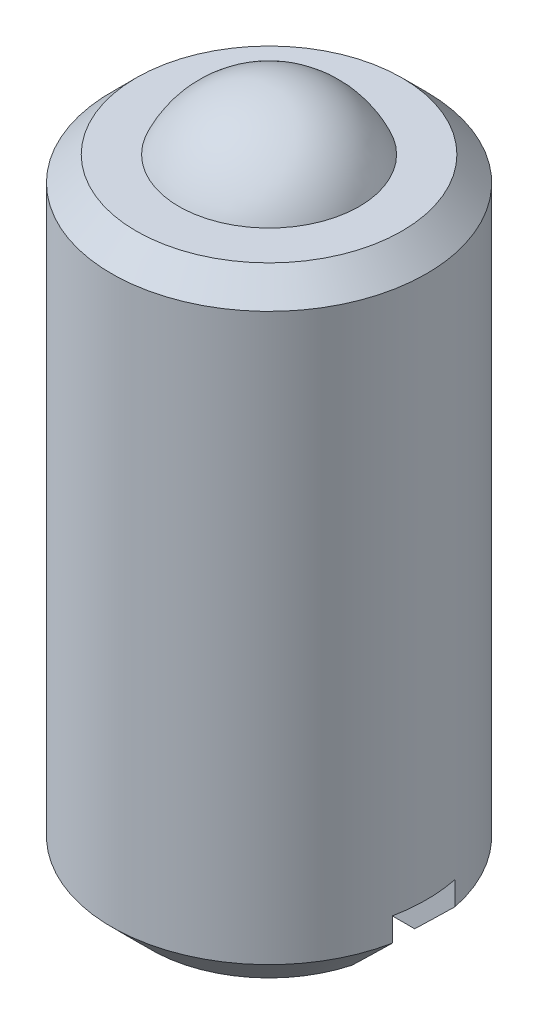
ISO-10303-21;
HEADER;
FILE_DESCRIPTION(('STEP AP214'),'2;1');
FILE_NAME('part.step','',(''),(''),'','','');
FILE_SCHEMA(('AUTOMOTIVE_DESIGN { 1 0 10303 214 1 1 1 1 }'));
ENDSEC;
DATA;
#1=APPLICATION_CONTEXT('core data for automotive mechanical design processes');
#2=APPLICATION_PROTOCOL_DEFINITION('international standard','automotive_design',2000,#1);
#3=PRODUCT_CONTEXT('',#1,'mechanical');
#4=PRODUCT('Part','Part','',(#3));
#5=PRODUCT_RELATED_PRODUCT_CATEGORY('part','',(#4));
#6=PRODUCT_DEFINITION_FORMATION('','',#4);
#7=PRODUCT_DEFINITION_CONTEXT('part definition',#1,'design');
#8=PRODUCT_DEFINITION('design','',#6,#7);
#9=PRODUCT_DEFINITION_SHAPE('','',#8);
#10=(LENGTH_UNIT() NAMED_UNIT(*) SI_UNIT(.MILLI.,.METRE.));
#11=(NAMED_UNIT(*) PLANE_ANGLE_UNIT() SI_UNIT($,.RADIAN.));
#12=(NAMED_UNIT(*) SI_UNIT($,.STERADIAN.) SOLID_ANGLE_UNIT());
#13=UNCERTAINTY_MEASURE_WITH_UNIT(LENGTH_MEASURE(1.E-05),#10,'distance_accuracy_value','');
#14=(GEOMETRIC_REPRESENTATION_CONTEXT(3) GLOBAL_UNCERTAINTY_ASSIGNED_CONTEXT((#13)) GLOBAL_UNIT_ASSIGNED_CONTEXT((#10,
#11,#12)) REPRESENTATION_CONTEXT('',''));
#15=CARTESIAN_POINT('',(0.,0.,0.));
#16=DIRECTION('',(0.,0.,1.));
#17=DIRECTION('',(1.,0.,0.));
#18=AXIS2_PLACEMENT_3D('',#15,#16,#17);
#19=CARTESIAN_POINT('',(-4.048,-36.4,-79.170781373));
#20=DIRECTION('',(0.,1.,0.));
#21=DIRECTION('',(1.,0.,0.));
#22=AXIS2_PLACEMENT_3D('',#19,#20,#21);
#23=PLANE('',#22);
#24=CARTESIAN_POINT('',(0.,-36.40000000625,-79.96));
#25=DIRECTION('',(0.,-1.,0.));
#26=DIRECTION('',(0.,0.,-1.));
#27=AXIS2_PLACEMENT_3D('',#24,#25,#26);
#28=CIRCLE('',#27,4.);
#29=CARTESIAN_POINT('',(-3.91696739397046,-36.400000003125,-80.770781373));
#30=VERTEX_POINT('',#29);
#31=CARTESIAN_POINT('',(-3.92136888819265,-36.400000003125,-79.170781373));
#32=VERTEX_POINT('',#31);
#33=EDGE_CURVE('E79',#30,#32,#28,.F.);
#34=ORIENTED_EDGE('',*,*,#33,.F.);
#35=DIRECTION('',(1.,0.,0.));
#36=VECTOR('',#35,1.);
#37=CARTESIAN_POINT('',(0.,-36.4,-80.770781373));
#38=LINE('',#37,#36);
#39=CARTESIAN_POINT('',(3.91696739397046,-36.400000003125,-80.770781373));
#40=VERTEX_POINT('',#39);
#41=EDGE_CURVE('E81',#30,#40,#38,.T.);
#42=ORIENTED_EDGE('',*,*,#41,.T.);
#43=CARTESIAN_POINT('',(0.,-36.40000000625,-79.96));
#44=DIRECTION('',(0.,-1.,0.));
#45=DIRECTION('',(0.,0.,-1.));
#46=AXIS2_PLACEMENT_3D('',#43,#44,#45);
#47=CIRCLE('',#46,4.);
#48=CARTESIAN_POINT('',(3.92136888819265,-36.400000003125,-79.170781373));
#49=VERTEX_POINT('',#48);
#50=EDGE_CURVE('E20',#49,#40,#47,.F.);
#51=ORIENTED_EDGE('',*,*,#50,.F.);
#52=DIRECTION('',(-1.,0.,0.));
#53=VECTOR('',#52,1.);
#54=CARTESIAN_POINT('',(0.,-36.4,-79.170781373));
#55=LINE('',#54,#53);
#56=EDGE_CURVE('E101',#49,#32,#55,.T.);
#57=ORIENTED_EDGE('',*,*,#56,.T.);
#58=EDGE_LOOP('',(#34,#42,#51,#57));
#59=FACE_BOUND('',#58,.T.);
#60=ADVANCED_FACE('F16',(#59),#23,.F.);
#61=CARTESIAN_POINT('',(3.916967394,-36.4,-80.770781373));
#62=DIRECTION('',(0.,0.,-1.));
#63=DIRECTION('',(0.,-1.,0.));
#64=AXIS2_PLACEMENT_3D('',#61,#62,#63);
#65=PLANE('',#64);
#66=CARTESIAN_POINT('',(-2.8883617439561,-38.0000000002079,-80.770781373));
#67=CARTESIAN_POINT('',(-2.97448036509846,-37.9170804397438,-80.770781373));
#68=CARTESIAN_POINT('',(-3.06046931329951,-37.8340264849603,-80.770781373));
#69=CARTESIAN_POINT('',(-3.23223360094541,-37.6676986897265,-80.770781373));
#70=CARTESIAN_POINT('',(-3.31800894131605,-37.5844248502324,-80.770781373));
#71=CARTESIAN_POINT('',(-3.4893923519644,-37.4177056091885,-80.770781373));
#72=CARTESIAN_POINT('',(-3.57500042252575,-37.33426020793,-80.770781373));
#73=CARTESIAN_POINT('',(-3.74607943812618,-37.1672282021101,-80.770781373));
#74=CARTESIAN_POINT('',(-3.83155038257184,-37.0836415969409,-80.770781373));
#75=CARTESIAN_POINT('',(-3.91696739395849,-36.9999999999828,-80.770781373));
#76=B_SPLINE_CURVE_WITH_KNOTS('',3,(#66,#67,#68,#69,#70,#71,#72,#73,#74,#75),.UNSPECIFIED.,.F.,
.F.,(4,2,2,2,4),(0.,0.358647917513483,0.717294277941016,1.07594002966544,1.43458732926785),.UNSPECIFIED.);
#77=CARTESIAN_POINT('',(-2.88836174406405,-38.0000000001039,-80.770781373));
#78=VERTEX_POINT('',#77);
#79=CARTESIAN_POINT('',(-3.91696739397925,-36.9999999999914,-80.770781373));
#80=VERTEX_POINT('',#79);
#81=EDGE_CURVE('E90',#78,#80,#76,.T.);
#82=ORIENTED_EDGE('',*,*,#81,.F.);
#83=DIRECTION('',(-1.,0.,0.));
#84=VECTOR('',#83,1.);
#85=CARTESIAN_POINT('',(0.,-38.,-80.770781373));
#86=LINE('',#85,#84);
#87=CARTESIAN_POINT('',(2.88836174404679,-38.0000000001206,-80.770781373));
#88=VERTEX_POINT('',#87);
#89=EDGE_CURVE('E173',#88,#78,#86,.T.);
#90=ORIENTED_EDGE('',*,*,#89,.F.);
#91=CARTESIAN_POINT('',(3.91696739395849,-36.9999999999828,-80.770781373));
#92=CARTESIAN_POINT('',(3.83155038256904,-37.0836415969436,-80.770781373));
#93=CARTESIAN_POINT('',(3.74607943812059,-37.1672282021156,-80.770781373));
#94=CARTESIAN_POINT('',(3.57500042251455,-37.3342602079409,-80.770781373));
#95=CARTESIAN_POINT('',(3.48939235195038,-37.4177056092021,-80.770781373));
#96=CARTESIAN_POINT('',(3.31800894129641,-37.5844248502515,-80.770781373));
#97=CARTESIAN_POINT('',(3.23223360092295,-37.6676986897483,-80.770781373));
#98=CARTESIAN_POINT('',(3.06046931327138,-37.8340264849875,-80.770781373));
#99=CARTESIAN_POINT('',(2.97448036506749,-37.9170804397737,-80.770781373));
#100=CARTESIAN_POINT('',(2.88836174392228,-38.0000000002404,-80.770781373));
#101=B_SPLINE_CURVE_WITH_KNOTS('',3,(#91,#92,#93,#94,#95,#96,#97,#98,#99,#100),.UNSPECIFIED.,
.F.,.F.,(4,2,2,2,4),(0.,0.35864729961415,0.717293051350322,1.07593941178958,1.4345873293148),.UNSPECIFIED.);
#102=CARTESIAN_POINT('',(3.91696739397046,-36.9999999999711,-80.770781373));
#103=VERTEX_POINT('',#102);
#104=EDGE_CURVE('E88',#103,#88,#101,.T.);
#105=ORIENTED_EDGE('',*,*,#104,.F.);
#106=DIRECTION('',(0.,-1.,0.));
#107=VECTOR('',#106,1.);
#108=CARTESIAN_POINT('',(3.916967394,-37.2,-80.770781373));
#109=LINE('',#108,#107);
#110=EDGE_CURVE('E71',#40,#103,#109,.T.);
#111=ORIENTED_EDGE('',*,*,#110,.F.);
#112=ORIENTED_EDGE('',*,*,#41,.F.);
#113=DIRECTION('',(0.,1.,0.));
#114=VECTOR('',#113,1.);
#115=CARTESIAN_POINT('',(-3.916967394,-37.2,-80.770781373));
#116=LINE('',#115,#114);
#117=EDGE_CURVE('E94',#80,#30,#116,.T.);
#118=ORIENTED_EDGE('',*,*,#117,.F.);
#119=EDGE_LOOP('',(#82,#90,#105,#111,#112,#118));
#120=FACE_BOUND('',#119,.T.);
#121=ADVANCED_FACE('F86',(#120),#65,.F.);
#122=CARTESIAN_POINT('',(3.921368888,-38.,-79.170781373));
#123=DIRECTION('',(0.,0.,1.));
#124=DIRECTION('',(0.,1.,0.));
#125=AXIS2_PLACEMENT_3D('',#122,#123,#124);
#126=PLANE('',#125);
#127=CARTESIAN_POINT('',(2.89432789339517,-38.0000000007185,-79.170781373));
#128=CARTESIAN_POINT('',(2.98029382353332,-37.9170568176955,-79.170781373));
#129=CARTESIAN_POINT('',(3.06613730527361,-37.8339869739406,-79.170781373));
#130=CARTESIAN_POINT('',(3.23762254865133,-37.6676399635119,-79.170781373));
#131=CARTESIAN_POINT('',(3.32326431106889,-37.5843627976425,-79.170781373));
#132=CARTESIAN_POINT('',(3.49438982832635,-37.4176466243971,-79.170781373));
#133=CARTESIAN_POINT('',(3.57987358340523,-37.3342076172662,-79.170781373));
#134=CARTESIAN_POINT('',(3.75071151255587,-37.1671963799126,-79.170781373));
#135=CARTESIAN_POINT('',(3.83606568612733,-37.083624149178,-79.170781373));
#136=CARTESIAN_POINT('',(3.92136888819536,-37.0000000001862,-79.170781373));
#137=B_SPLINE_CURVE_WITH_KNOTS('',3,(#127,#128,#129,#130,#131,#132,#133,#134,#135,#136),
.UNSPECIFIED.,.F.,.F.,(4,2,2,2,4),(0.,0.358367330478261,0.716733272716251,1.07509867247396,
1.43346545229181),.UNSPECIFIED.);
#138=CARTESIAN_POINT('',(2.89432789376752,-38.0000000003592,-79.170781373));
#139=VERTEX_POINT('',#138);
#140=CARTESIAN_POINT('',(3.92136888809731,-37.0000000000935,-79.170781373));
#141=VERTEX_POINT('',#140);
#142=EDGE_CURVE('E114',#139,#141,#137,.T.);
#143=ORIENTED_EDGE('',*,*,#142,.F.);
#144=DIRECTION('',(1.,0.,0.));
#145=VECTOR('',#144,1.);
#146=CARTESIAN_POINT('',(0.,-38.,-79.170781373));
#147=LINE('',#146,#145);
#148=CARTESIAN_POINT('',(-2.89432789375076,-38.0000000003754,-79.170781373));
#149=VERTEX_POINT('',#148);
#150=EDGE_CURVE('E113',#149,#139,#147,.T.);
#151=ORIENTED_EDGE('',*,*,#150,.F.);
#152=CARTESIAN_POINT('',(-3.9213688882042,-37.0000000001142,-79.1707813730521));
#153=CARTESIAN_POINT('',(-3.83606568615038,-37.0836241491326,-79.1707813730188));
#154=CARTESIAN_POINT('',(-3.75071151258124,-37.1671963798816,-79.170781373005));
#155=CARTESIAN_POINT('',(-3.57987358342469,-37.3342076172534,-79.1707813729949));
#156=CARTESIAN_POINT('',(-3.49438982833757,-37.4176466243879,-79.1707813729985));
#157=CARTESIAN_POINT('',(-3.32326431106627,-37.5843627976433,-79.1707813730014));
#158=CARTESIAN_POINT('',(-3.2376225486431,-37.667639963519,-79.1707813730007));
#159=CARTESIAN_POINT('',(-3.06613730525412,-37.8339869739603,-79.1707813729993));
#160=CARTESIAN_POINT('',(-2.98029382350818,-37.9170568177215,-79.1707813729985));
#161=CARTESIAN_POINT('',(-2.89432789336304,-38.0000000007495,-79.170781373));
#162=B_SPLINE_CURVE_WITH_KNOTS('',3,(#152,#153,#154,#155,#156,#157,#158,#159,#160,#161),
.UNSPECIFIED.,.F.,.F.,(4,2,2,2,4),(0.,0.358366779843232,0.716732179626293,1.07509812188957,
1.43346545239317),.UNSPECIFIED.);
#163=CARTESIAN_POINT('',(-3.92136888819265,-37.0000000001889,-79.170781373));
#164=VERTEX_POINT('',#163);
#165=EDGE_CURVE('E121',#164,#149,#162,.T.);
#166=ORIENTED_EDGE('',*,*,#165,.F.);
#167=DIRECTION('',(0.,-1.,0.));
#168=VECTOR('',#167,1.);
#169=CARTESIAN_POINT('',(-3.921368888,-37.2,-79.170781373));
#170=LINE('',#169,#168);
#171=EDGE_CURVE('E103',#32,#164,#170,.T.);
#172=ORIENTED_EDGE('',*,*,#171,.F.);
#173=ORIENTED_EDGE('',*,*,#56,.F.);
#174=DIRECTION('',(0.,1.,0.));
#175=VECTOR('',#174,1.);
#176=CARTESIAN_POINT('',(3.921368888,-37.2,-79.170781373));
#177=LINE('',#176,#175);
#178=EDGE_CURVE('E75',#141,#49,#177,.T.);
#179=ORIENTED_EDGE('',*,*,#178,.F.);
#180=EDGE_LOOP('',(#143,#151,#166,#172,#173,#179));
#181=FACE_BOUND('',#180,.T.);
#182=ADVANCED_FACE('F130',(#181),#126,.F.);
#183=CARTESIAN_POINT('',(2.923022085,-38.,-80.770781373));
#184=DIRECTION('',(0.,-1.,0.));
#185=DIRECTION('',(-1.,0.,0.));
#186=AXIS2_PLACEMENT_3D('',#183,#184,#185);
#187=PLANE('',#186);
#188=ORIENTED_EDGE('',*,*,#89,.T.);
#189=CARTESIAN_POINT('',(0.,-38.,-79.96));
#190=DIRECTION('',(0.,1.,0.));
#191=DIRECTION('',(0.,0.,1.));
#192=AXIS2_PLACEMENT_3D('',#189,#190,#191);
#193=CIRCLE('',#192,3.);
#194=EDGE_CURVE('E110',#78,#88,#193,.F.);
#195=ORIENTED_EDGE('',*,*,#194,.T.);
#196=EDGE_LOOP('',(#188,#195));
#197=FACE_BOUND('',#196,.T.);
#198=ADVANCED_FACE('F135',(#197),#187,.T.);
#199=CARTESIAN_POINT('',(2.929059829,-38.,-76.946735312));
#200=DIRECTION('',(0.,-1.,0.));
#201=DIRECTION('',(-1.,0.,0.));
#202=AXIS2_PLACEMENT_3D('',#199,#200,#201);
#203=PLANE('',#202);
#204=ORIENTED_EDGE('',*,*,#150,.T.);
#205=CARTESIAN_POINT('',(0.,-38.,-79.96));
#206=DIRECTION('',(0.,1.,0.));
#207=DIRECTION('',(0.,0.,1.));
#208=AXIS2_PLACEMENT_3D('',#205,#206,#207);
#209=CIRCLE('',#208,3.);
#210=EDGE_CURVE('E104',#139,#149,#209,.F.);
#211=ORIENTED_EDGE('',*,*,#210,.T.);
#212=EDGE_LOOP('',(#204,#211));
#213=FACE_BOUND('',#212,.T.);
#214=ADVANCED_FACE('F141',(#213),#203,.T.);
#215=CARTESIAN_POINT('',(0.,-38.,-79.96));
#216=DIRECTION('',(0.,1.,0.));
#217=DIRECTION('',(0.,0.,1.));
#218=AXIS2_PLACEMENT_3D('',#215,#216,#217);
#219=CONICAL_SURFACE('',#218,3.,0.785398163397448);
#220=CARTESIAN_POINT('',(0.,-37.,-79.96));
#221=DIRECTION('',(0.,-1.,0.));
#222=DIRECTION('',(-1.,0.,0.));
#223=AXIS2_PLACEMENT_3D('',#220,#221,#222);
#224=CIRCLE('',#223,4.);
#225=EDGE_CURVE('E100',#80,#103,#224,.T.);
#226=ORIENTED_EDGE('',*,*,#225,.T.);
#227=ORIENTED_EDGE('',*,*,#104,.T.);
#228=ORIENTED_EDGE('',*,*,#194,.F.);
#229=ORIENTED_EDGE('',*,*,#81,.T.);
#230=EDGE_LOOP('',(#226,#227,#228,#229));
#231=FACE_BOUND('',#230,.T.);
#232=ADVANCED_FACE('F144',(#231),#219,.T.);
#233=CARTESIAN_POINT('',(0.,-38.,-79.96));
#234=DIRECTION('',(0.,1.,0.));
#235=DIRECTION('',(0.,0.,1.));
#236=AXIS2_PLACEMENT_3D('',#233,#234,#235);
#237=CONICAL_SURFACE('',#236,3.,0.785398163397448);
#238=CARTESIAN_POINT('',(0.,-37.,-79.96));
#239=DIRECTION('',(0.,-1.,0.));
#240=DIRECTION('',(-1.,0.,0.));
#241=AXIS2_PLACEMENT_3D('',#238,#239,#240);
#242=CIRCLE('',#241,4.);
#243=EDGE_CURVE('E96',#141,#164,#242,.T.);
#244=ORIENTED_EDGE('',*,*,#243,.T.);
#245=ORIENTED_EDGE('',*,*,#165,.T.);
#246=ORIENTED_EDGE('',*,*,#210,.F.);
#247=ORIENTED_EDGE('',*,*,#142,.T.);
#248=EDGE_LOOP('',(#244,#245,#246,#247));
#249=FACE_BOUND('',#248,.T.);
#250=ADVANCED_FACE('F126',(#249),#237,.T.);
#251=CARTESIAN_POINT('',(0.,-23.,-79.96));
#252=DIRECTION('',(0.,-1.,0.));
#253=DIRECTION('',(1.,0.,0.));
#254=AXIS2_PLACEMENT_3D('',#251,#252,#253);
#255=SPHERICAL_SURFACE('',#254,2.5);
#256=CARTESIAN_POINT('',(-2.5E-08,-20.5,-79.96));
#257=VERTEX_POINT('',#256);
#258=VERTEX_LOOP('',#257);
#259=FACE_BOUND('',#258,.T.);
#260=CARTESIAN_POINT('',(0.,-22.,-79.96));
#261=DIRECTION('',(0.,-1.,0.));
#262=DIRECTION('',(0.,0.,-1.));
#263=AXIS2_PLACEMENT_3D('',#260,#261,#262);
#264=CIRCLE('',#263,2.29128784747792);
#265=CARTESIAN_POINT('',(0.,-22.,-82.2512878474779));
#266=VERTEX_POINT('',#265);
#267=EDGE_CURVE('E99',#266,#266,#264,.T.);
#268=ORIENTED_EDGE('',*,*,#267,.F.);
#269=EDGE_LOOP('',(#268));
#270=FACE_BOUND('',#269,.T.);
#271=ADVANCED_FACE('F164',(#259,#270),#255,.T.);
#272=CARTESIAN_POINT('',(0.,-22.625,-79.96));
#273=DIRECTION('',(0.,-1.,0.));
#274=DIRECTION('',(0.,0.,-1.));
#275=AXIS2_PLACEMENT_3D('',#272,#273,#274);
#276=CYLINDRICAL_SURFACE('',#275,4.);
#277=CARTESIAN_POINT('',(0.,-22.625,-79.96));
#278=DIRECTION('',(0.,-1.,0.));
#279=DIRECTION('',(1.,0.,0.));
#280=AXIS2_PLACEMENT_3D('',#277,#278,#279);
#281=CIRCLE('',#280,4.);
#282=CARTESIAN_POINT('',(4.,-22.625,-79.96));
#283=VERTEX_POINT('',#282);
#284=EDGE_CURVE('E26',#283,#283,#281,.T.);
#285=ORIENTED_EDGE('',*,*,#284,.T.);
#286=EDGE_LOOP('',(#285));
#287=FACE_BOUND('',#286,.T.);
#288=ORIENTED_EDGE('',*,*,#117,.T.);
#289=ORIENTED_EDGE('',*,*,#33,.T.);
#290=ORIENTED_EDGE('',*,*,#171,.T.);
#291=ORIENTED_EDGE('',*,*,#243,.F.);
#292=ORIENTED_EDGE('',*,*,#178,.T.);
#293=ORIENTED_EDGE('',*,*,#50,.T.);
#294=ORIENTED_EDGE('',*,*,#110,.T.);
#295=ORIENTED_EDGE('',*,*,#225,.F.);
#296=EDGE_LOOP('',(#288,#289,#290,#291,#292,#293,#294,#295));
#297=FACE_BOUND('',#296,.T.);
#298=ADVANCED_FACE('F68',(#287,#297),#276,.T.);
#299=CARTESIAN_POINT('',(-3.4155,-22.,-76.5445));
#300=DIRECTION('',(0.,1.,0.));
#301=DIRECTION('',(1.,0.,0.));
#302=AXIS2_PLACEMENT_3D('',#299,#300,#301);
#303=PLANE('',#302);
#304=ORIENTED_EDGE('',*,*,#267,.T.);
#305=EDGE_LOOP('',(#304));
#306=FACE_BOUND('',#305,.T.);
#307=CARTESIAN_POINT('',(0.,-22.,-79.96));
#308=DIRECTION('',(0.,-1.,0.));
#309=DIRECTION('',(0.,0.,-1.));
#310=AXIS2_PLACEMENT_3D('',#307,#308,#309);
#311=CIRCLE('',#310,3.37500000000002);
#312=CARTESIAN_POINT('',(0.,-22.,-83.335));
#313=VERTEX_POINT('',#312);
#314=EDGE_CURVE('E11',#313,#313,#311,.F.);
#315=ORIENTED_EDGE('',*,*,#314,.T.);
#316=EDGE_LOOP('',(#315));
#317=FACE_BOUND('',#316,.T.);
#318=ADVANCED_FACE('F18',(#306,#317),#303,.T.);
#319=CARTESIAN_POINT('',(0.,-22.,-79.96));
#320=DIRECTION('',(0.,-1.,0.));
#321=DIRECTION('',(0.,0.,-1.));
#322=AXIS2_PLACEMENT_3D('',#319,#320,#321);
#323=CONICAL_SURFACE('',#322,3.375,0.785398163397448);
#324=ORIENTED_EDGE('',*,*,#314,.F.);
#325=EDGE_LOOP('',(#324));
#326=FACE_BOUND('',#325,.T.);
#327=ORIENTED_EDGE('',*,*,#284,.F.);
#328=EDGE_LOOP('',(#327));
#329=FACE_BOUND('',#328,.T.);
#330=ADVANCED_FACE('F152',(#326,#329),#323,.T.);
#331=CLOSED_SHELL('',(#60,#121,#182,#198,#214,#232,#250,#271,#298,#318,#330));
#332=MANIFOLD_SOLID_BREP('B1',#331);
#333=ADVANCED_BREP_SHAPE_REPRESENTATION('',(#18,#332),#14);
#334=SHAPE_DEFINITION_REPRESENTATION(#9,#333);
ENDSEC;
END-ISO-10303-21;
